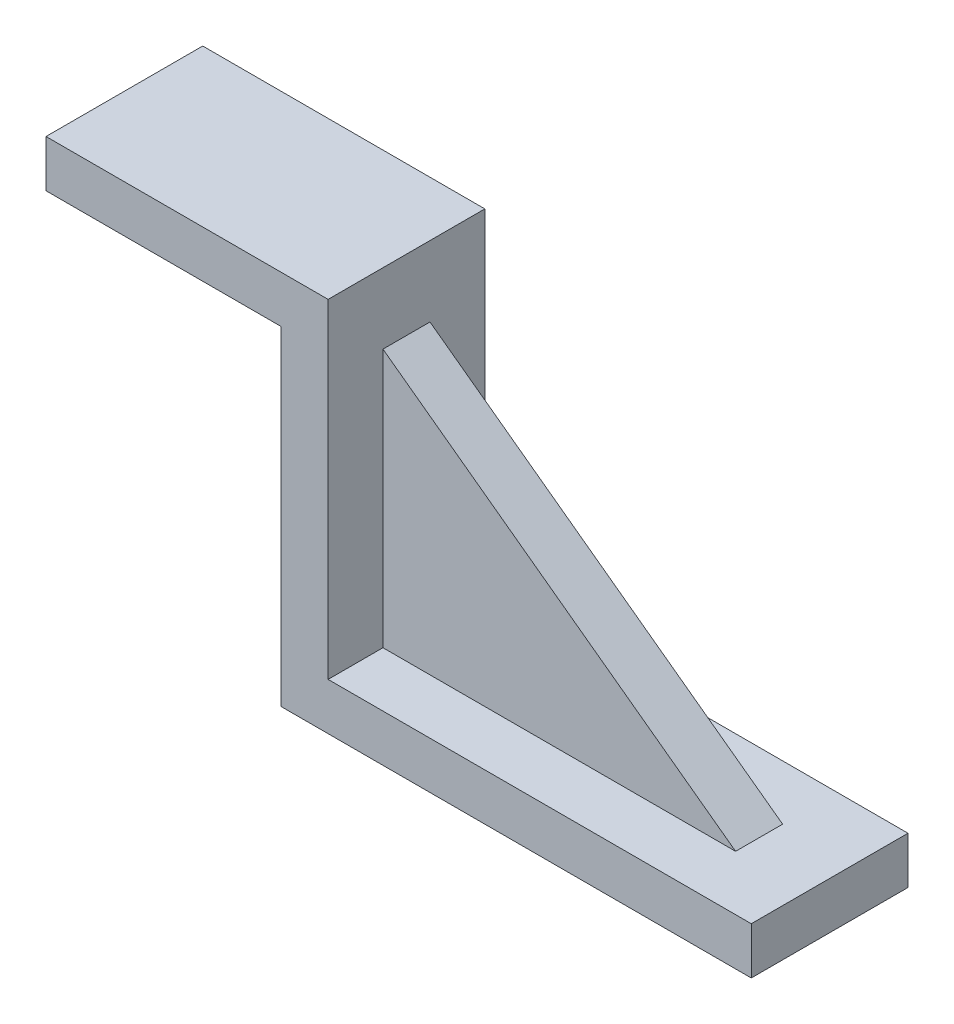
ISO-10303-21;
HEADER;
FILE_DESCRIPTION(('STEP AP214'),'2;1');
FILE_NAME('part.step','',(''),(''),'','','');
FILE_SCHEMA(('AUTOMOTIVE_DESIGN { 1 0 10303 214 1 1 1 1 }'));
ENDSEC;
DATA;
#1=APPLICATION_CONTEXT('core data for automotive mechanical design processes');
#2=APPLICATION_PROTOCOL_DEFINITION('international standard','automotive_design',2000,#1);
#3=PRODUCT_CONTEXT('',#1,'mechanical');
#4=PRODUCT('Part','Part','',(#3));
#5=PRODUCT_RELATED_PRODUCT_CATEGORY('part','',(#4));
#6=PRODUCT_DEFINITION_FORMATION('','',#4);
#7=PRODUCT_DEFINITION_CONTEXT('part definition',#1,'design');
#8=PRODUCT_DEFINITION('design','',#6,#7);
#9=PRODUCT_DEFINITION_SHAPE('','',#8);
#10=(LENGTH_UNIT() NAMED_UNIT(*) SI_UNIT(.MILLI.,.METRE.));
#11=(NAMED_UNIT(*) PLANE_ANGLE_UNIT() SI_UNIT($,.RADIAN.));
#12=(NAMED_UNIT(*) SI_UNIT($,.STERADIAN.) SOLID_ANGLE_UNIT());
#13=UNCERTAINTY_MEASURE_WITH_UNIT(LENGTH_MEASURE(1.E-05),#10,'distance_accuracy_value','');
#14=(GEOMETRIC_REPRESENTATION_CONTEXT(3) GLOBAL_UNCERTAINTY_ASSIGNED_CONTEXT((#13)) GLOBAL_UNIT_ASSIGNED_CONTEXT((#10,
#11,#12)) REPRESENTATION_CONTEXT('',''));
#15=CARTESIAN_POINT('',(0.,0.,0.));
#16=DIRECTION('',(0.,0.,1.));
#17=DIRECTION('',(1.,0.,0.));
#18=AXIS2_PLACEMENT_3D('',#15,#16,#17);
#19=CARTESIAN_POINT('',(-20.,16.,3.33333333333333));
#20=DIRECTION('',(0.,-1.,0.));
#21=DIRECTION('',(0.,0.,-1.));
#22=AXIS2_PLACEMENT_3D('',#19,#20,#21);
#23=PLANE('',#22);
#24=DIRECTION('',(1.,0.,0.));
#25=VECTOR('',#24,1.);
#26=CARTESIAN_POINT('',(-20.,16.,-3.33333333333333));
#27=LINE('',#26,#25);
#28=CARTESIAN_POINT('',(-18.,16.,-3.33333333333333));
#29=VERTEX_POINT('',#28);
#30=CARTESIAN_POINT('',(-30.,16.,-3.33333333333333));
#31=VERTEX_POINT('',#30);
#32=EDGE_CURVE('E136',#29,#31,#27,.F.);
#33=ORIENTED_EDGE('',*,*,#32,.T.);
#34=DIRECTION('',(0.,0.,-1.));
#35=VECTOR('',#34,1.);
#36=CARTESIAN_POINT('',(-30.,16.,3.33333333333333));
#37=LINE('',#36,#35);
#38=CARTESIAN_POINT('',(-30.,16.,3.33333333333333));
#39=VERTEX_POINT('',#38);
#40=EDGE_CURVE('E125',#39,#31,#37,.T.);
#41=ORIENTED_EDGE('',*,*,#40,.F.);
#42=DIRECTION('',(1.,0.,0.));
#43=VECTOR('',#42,1.);
#44=CARTESIAN_POINT('',(-20.,16.,3.33333333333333));
#45=LINE('',#44,#43);
#46=CARTESIAN_POINT('',(-18.,16.,3.33333333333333));
#47=VERTEX_POINT('',#46);
#48=EDGE_CURVE('E159',#47,#39,#45,.F.);
#49=ORIENTED_EDGE('',*,*,#48,.F.);
#50=DIRECTION('',(0.,0.,-1.));
#51=VECTOR('',#50,1.);
#52=CARTESIAN_POINT('',(-18.,16.,3.33333333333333));
#53=LINE('',#52,#51);
#54=EDGE_CURVE('E180',#47,#29,#53,.T.);
#55=ORIENTED_EDGE('',*,*,#54,.T.);
#56=EDGE_LOOP('',(#33,#41,#49,#55));
#57=FACE_BOUND('',#56,.T.);
#58=ADVANCED_FACE('F33',(#57),#23,.F.);
#59=CARTESIAN_POINT('',(-30.,14.,3.33333333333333));
#60=DIRECTION('',(-1.,0.,0.));
#61=DIRECTION('',(0.,0.,1.));
#62=AXIS2_PLACEMENT_3D('',#59,#60,#61);
#63=PLANE('',#62);
#64=ORIENTED_EDGE('',*,*,#40,.T.);
#65=DIRECTION('',(0.,1.,0.));
#66=VECTOR('',#65,1.);
#67=CARTESIAN_POINT('',(-30.,14.,-3.33333333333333));
#68=LINE('',#67,#66);
#69=CARTESIAN_POINT('',(-30.,14.,-3.33333333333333));
#70=VERTEX_POINT('',#69);
#71=EDGE_CURVE('E139',#70,#31,#68,.T.);
#72=ORIENTED_EDGE('',*,*,#71,.F.);
#73=DIRECTION('',(0.,0.,-1.));
#74=VECTOR('',#73,1.);
#75=CARTESIAN_POINT('',(-30.,14.,3.33333333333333));
#76=LINE('',#75,#74);
#77=CARTESIAN_POINT('',(-30.,14.,3.33333333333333));
#78=VERTEX_POINT('',#77);
#79=EDGE_CURVE('E194',#78,#70,#76,.T.);
#80=ORIENTED_EDGE('',*,*,#79,.F.);
#81=DIRECTION('',(0.,1.,0.));
#82=VECTOR('',#81,1.);
#83=CARTESIAN_POINT('',(-30.,14.,3.33333333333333));
#84=LINE('',#83,#82);
#85=EDGE_CURVE('E161',#78,#39,#84,.T.);
#86=ORIENTED_EDGE('',*,*,#85,.T.);
#87=EDGE_LOOP('',(#64,#72,#80,#86));
#88=FACE_BOUND('',#87,.T.);
#89=ADVANCED_FACE('F199',(#88),#63,.T.);
#90=CARTESIAN_POINT('',(-20.,14.,3.33333333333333));
#91=DIRECTION('',(0.,-1.,0.));
#92=DIRECTION('',(0.,0.,-1.));
#93=AXIS2_PLACEMENT_3D('',#90,#91,#92);
#94=PLANE('',#93);
#95=ORIENTED_EDGE('',*,*,#79,.T.);
#96=DIRECTION('',(-1.,0.,0.));
#97=VECTOR('',#96,1.);
#98=CARTESIAN_POINT('',(-20.,14.,-3.33333333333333));
#99=LINE('',#98,#97);
#100=CARTESIAN_POINT('',(-20.,14.,-3.33333333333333));
#101=VERTEX_POINT('',#100);
#102=EDGE_CURVE('E142',#101,#70,#99,.T.);
#103=ORIENTED_EDGE('',*,*,#102,.F.);
#104=DIRECTION('',(0.,0.,-1.));
#105=VECTOR('',#104,1.);
#106=CARTESIAN_POINT('',(-20.,14.,3.33333333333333));
#107=LINE('',#106,#105);
#108=CARTESIAN_POINT('',(-20.,14.,3.33333333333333));
#109=VERTEX_POINT('',#108);
#110=EDGE_CURVE('E192',#109,#101,#107,.T.);
#111=ORIENTED_EDGE('',*,*,#110,.F.);
#112=DIRECTION('',(-1.,0.,0.));
#113=VECTOR('',#112,1.);
#114=CARTESIAN_POINT('',(-20.,14.,3.33333333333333));
#115=LINE('',#114,#113);
#116=EDGE_CURVE('E164',#109,#78,#115,.T.);
#117=ORIENTED_EDGE('',*,*,#116,.T.);
#118=EDGE_LOOP('',(#95,#103,#111,#117));
#119=FACE_BOUND('',#118,.T.);
#120=ADVANCED_FACE('F211',(#119),#94,.T.);
#121=CARTESIAN_POINT('',(-20.,0.,3.33333333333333));
#122=DIRECTION('',(-1.,0.,0.));
#123=DIRECTION('',(0.,0.,1.));
#124=AXIS2_PLACEMENT_3D('',#121,#122,#123);
#125=PLANE('',#124);
#126=ORIENTED_EDGE('',*,*,#110,.T.);
#127=DIRECTION('',(0.,1.,0.));
#128=VECTOR('',#127,1.);
#129=CARTESIAN_POINT('',(-20.,0.,-3.33333333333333));
#130=LINE('',#129,#128);
#131=CARTESIAN_POINT('',(-20.,0.,-3.33333333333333));
#132=VERTEX_POINT('',#131);
#133=EDGE_CURVE('E145',#132,#101,#130,.T.);
#134=ORIENTED_EDGE('',*,*,#133,.F.);
#135=DIRECTION('',(0.,0.,-1.));
#136=VECTOR('',#135,1.);
#137=CARTESIAN_POINT('',(-20.,0.,3.33333333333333));
#138=LINE('',#137,#136);
#139=CARTESIAN_POINT('',(-20.,0.,3.33333333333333));
#140=VERTEX_POINT('',#139);
#141=EDGE_CURVE('E190',#140,#132,#138,.T.);
#142=ORIENTED_EDGE('',*,*,#141,.F.);
#143=DIRECTION('',(0.,1.,0.));
#144=VECTOR('',#143,1.);
#145=CARTESIAN_POINT('',(-20.,0.,3.33333333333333));
#146=LINE('',#145,#144);
#147=EDGE_CURVE('E167',#140,#109,#146,.T.);
#148=ORIENTED_EDGE('',*,*,#147,.T.);
#149=EDGE_LOOP('',(#126,#134,#142,#148));
#150=FACE_BOUND('',#149,.T.);
#151=ADVANCED_FACE('F229',(#150),#125,.T.);
#152=CARTESIAN_POINT('',(0.,0.,3.33333333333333));
#153=DIRECTION('',(0.,-1.,0.));
#154=DIRECTION('',(1.,0.,0.));
#155=AXIS2_PLACEMENT_3D('',#152,#153,#154);
#156=PLANE('',#155);
#157=ORIENTED_EDGE('',*,*,#141,.T.);
#158=DIRECTION('',(-1.,0.,0.));
#159=VECTOR('',#158,1.);
#160=CARTESIAN_POINT('',(0.,0.,-3.33333333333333));
#161=LINE('',#160,#159);
#162=CARTESIAN_POINT('',(0.,0.,-3.33333333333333));
#163=VERTEX_POINT('',#162);
#164=EDGE_CURVE('E148',#163,#132,#161,.T.);
#165=ORIENTED_EDGE('',*,*,#164,.F.);
#166=DIRECTION('',(0.,0.,-1.));
#167=VECTOR('',#166,1.);
#168=CARTESIAN_POINT('',(0.,0.,3.33333333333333));
#169=LINE('',#168,#167);
#170=CARTESIAN_POINT('',(0.,0.,3.33333333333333));
#171=VERTEX_POINT('',#170);
#172=EDGE_CURVE('E188',#171,#163,#169,.T.);
#173=ORIENTED_EDGE('',*,*,#172,.F.);
#174=DIRECTION('',(-1.,0.,0.));
#175=VECTOR('',#174,1.);
#176=CARTESIAN_POINT('',(0.,0.,3.33333333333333));
#177=LINE('',#176,#175);
#178=EDGE_CURVE('E170',#171,#140,#177,.T.);
#179=ORIENTED_EDGE('',*,*,#178,.T.);
#180=EDGE_LOOP('',(#157,#165,#173,#179));
#181=FACE_BOUND('',#180,.T.);
#182=ADVANCED_FACE('F227',(#181),#156,.T.);
#183=CARTESIAN_POINT('',(0.,2.,3.33333333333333));
#184=DIRECTION('',(1.,0.,0.));
#185=DIRECTION('',(0.,1.,0.));
#186=AXIS2_PLACEMENT_3D('',#183,#184,#185);
#187=PLANE('',#186);
#188=DIRECTION('',(0.,-1.,0.));
#189=VECTOR('',#188,1.);
#190=CARTESIAN_POINT('',(0.,2.,-3.33333333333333));
#191=LINE('',#190,#189);
#192=CARTESIAN_POINT('',(0.,2.,-3.33333333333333));
#193=VERTEX_POINT('',#192);
#194=EDGE_CURVE('E151',#193,#163,#191,.T.);
#195=ORIENTED_EDGE('',*,*,#194,.F.);
#196=DIRECTION('',(0.,0.,-1.));
#197=VECTOR('',#196,1.);
#198=CARTESIAN_POINT('',(0.,2.,3.33333333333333));
#199=LINE('',#198,#197);
#200=CARTESIAN_POINT('',(0.,2.,3.33333333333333));
#201=VERTEX_POINT('',#200);
#202=EDGE_CURVE('E186',#201,#193,#199,.T.);
#203=ORIENTED_EDGE('',*,*,#202,.F.);
#204=DIRECTION('',(0.,-1.,0.));
#205=VECTOR('',#204,1.);
#206=CARTESIAN_POINT('',(0.,2.,3.33333333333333));
#207=LINE('',#206,#205);
#208=EDGE_CURVE('E173',#201,#171,#207,.T.);
#209=ORIENTED_EDGE('',*,*,#208,.T.);
#210=ORIENTED_EDGE('',*,*,#172,.T.);
#211=EDGE_LOOP('',(#195,#203,#209,#210));
#212=FACE_BOUND('',#211,.T.);
#213=ADVANCED_FACE('F223',(#212),#187,.T.);
#214=CARTESIAN_POINT('',(0.,2.,3.33333333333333));
#215=DIRECTION('',(0.,-1.,0.));
#216=DIRECTION('',(1.,0.,0.));
#217=AXIS2_PLACEMENT_3D('',#214,#215,#216);
#218=PLANE('',#217);
#219=DIRECTION('',(0.,0.,-1.));
#220=VECTOR('',#219,1.);
#221=CARTESIAN_POINT('',(-3.,2.,3.33333333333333));
#222=LINE('',#221,#220);
#223=CARTESIAN_POINT('',(-3.,2.,-1.));
#224=VERTEX_POINT('',#223);
#225=CARTESIAN_POINT('',(-3.,2.,1.));
#226=VERTEX_POINT('',#225);
#227=EDGE_CURVE('E47',#224,#226,#222,.F.);
#228=ORIENTED_EDGE('',*,*,#227,.T.);
#229=DIRECTION('',(-1.,0.,0.));
#230=VECTOR('',#229,1.);
#231=CARTESIAN_POINT('',(0.,2.,1.));
#232=LINE('',#231,#230);
#233=CARTESIAN_POINT('',(-18.,2.,1.));
#234=VERTEX_POINT('',#233);
#235=EDGE_CURVE('E133',#226,#234,#232,.T.);
#236=ORIENTED_EDGE('',*,*,#235,.T.);
#237=DIRECTION('',(0.,0.,-1.));
#238=VECTOR('',#237,1.);
#239=CARTESIAN_POINT('',(-18.,2.,3.33333333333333));
#240=LINE('',#239,#238);
#241=CARTESIAN_POINT('',(-18.,2.,3.33333333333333));
#242=VERTEX_POINT('',#241);
#243=EDGE_CURVE('E184',#242,#234,#240,.T.);
#244=ORIENTED_EDGE('',*,*,#243,.F.);
#245=DIRECTION('',(-1.,0.,0.));
#246=VECTOR('',#245,1.);
#247=CARTESIAN_POINT('',(0.,2.,3.33333333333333));
#248=LINE('',#247,#246);
#249=EDGE_CURVE('E176',#201,#242,#248,.T.);
#250=ORIENTED_EDGE('',*,*,#249,.F.);
#251=ORIENTED_EDGE('',*,*,#202,.T.);
#252=DIRECTION('',(-1.,0.,0.));
#253=VECTOR('',#252,1.);
#254=CARTESIAN_POINT('',(0.,2.,-3.33333333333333));
#255=LINE('',#254,#253);
#256=CARTESIAN_POINT('',(-18.,2.,-3.33333333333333));
#257=VERTEX_POINT('',#256);
#258=EDGE_CURVE('E154',#193,#257,#255,.T.);
#259=ORIENTED_EDGE('',*,*,#258,.T.);
#260=CARTESIAN_POINT('',(-18.,2.,-1.));
#261=VERTEX_POINT('',#260);
#262=EDGE_CURVE('E183',#261,#257,#240,.T.);
#263=ORIENTED_EDGE('',*,*,#262,.F.);
#264=DIRECTION('',(-1.,0.,0.));
#265=VECTOR('',#264,1.);
#266=CARTESIAN_POINT('',(0.,2.,-1.));
#267=LINE('',#266,#265);
#268=EDGE_CURVE('E52',#224,#261,#267,.T.);
#269=ORIENTED_EDGE('',*,*,#268,.F.);
#270=EDGE_LOOP('',(#228,#236,#244,#250,#251,#259,#263,#269));
#271=FACE_BOUND('',#270,.T.);
#272=ADVANCED_FACE('F265',(#271),#218,.F.);
#273=CARTESIAN_POINT('',(-18.,0.,3.33333333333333));
#274=DIRECTION('',(-1.,0.,0.));
#275=DIRECTION('',(0.,0.,1.));
#276=AXIS2_PLACEMENT_3D('',#273,#274,#275);
#277=PLANE('',#276);
#278=ORIENTED_EDGE('',*,*,#243,.T.);
#279=DIRECTION('',(0.,1.,0.));
#280=VECTOR('',#279,1.);
#281=CARTESIAN_POINT('',(-18.,0.,1.));
#282=LINE('',#281,#280);
#283=CARTESIAN_POINT('',(-18.,13.,1.));
#284=VERTEX_POINT('',#283);
#285=EDGE_CURVE('E11',#234,#284,#282,.T.);
#286=ORIENTED_EDGE('',*,*,#285,.T.);
#287=DIRECTION('',(0.,0.,1.));
#288=VECTOR('',#287,1.);
#289=CARTESIAN_POINT('',(-18.,13.,3.33333333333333));
#290=LINE('',#289,#288);
#291=CARTESIAN_POINT('',(-18.,13.,-1.));
#292=VERTEX_POINT('',#291);
#293=EDGE_CURVE('E40',#284,#292,#290,.F.);
#294=ORIENTED_EDGE('',*,*,#293,.T.);
#295=DIRECTION('',(0.,1.,0.));
#296=VECTOR('',#295,1.);
#297=CARTESIAN_POINT('',(-18.,0.,-1.));
#298=LINE('',#297,#296);
#299=EDGE_CURVE('E115',#261,#292,#298,.T.);
#300=ORIENTED_EDGE('',*,*,#299,.F.);
#301=ORIENTED_EDGE('',*,*,#262,.T.);
#302=DIRECTION('',(0.,1.,0.));
#303=VECTOR('',#302,1.);
#304=CARTESIAN_POINT('',(-18.,0.,-3.33333333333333));
#305=LINE('',#304,#303);
#306=EDGE_CURVE('E157',#257,#29,#305,.T.);
#307=ORIENTED_EDGE('',*,*,#306,.T.);
#308=ORIENTED_EDGE('',*,*,#54,.F.);
#309=DIRECTION('',(0.,1.,0.));
#310=VECTOR('',#309,1.);
#311=CARTESIAN_POINT('',(-18.,0.,3.33333333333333));
#312=LINE('',#311,#310);
#313=EDGE_CURVE('E178',#242,#47,#312,.T.);
#314=ORIENTED_EDGE('',*,*,#313,.F.);
#315=EDGE_LOOP('',(#278,#286,#294,#300,#301,#307,#308,#314));
#316=FACE_BOUND('',#315,.T.);
#317=ADVANCED_FACE('F114',(#316),#277,.F.);
#318=CARTESIAN_POINT('',(-30.,16.,3.33333333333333));
#319=DIRECTION('',(0.,0.,1.));
#320=DIRECTION('',(1.,0.,0.));
#321=AXIS2_PLACEMENT_3D('',#318,#319,#320);
#322=PLANE('',#321);
#323=ORIENTED_EDGE('',*,*,#48,.T.);
#324=ORIENTED_EDGE('',*,*,#85,.F.);
#325=ORIENTED_EDGE('',*,*,#116,.F.);
#326=ORIENTED_EDGE('',*,*,#147,.F.);
#327=ORIENTED_EDGE('',*,*,#178,.F.);
#328=ORIENTED_EDGE('',*,*,#208,.F.);
#329=ORIENTED_EDGE('',*,*,#249,.T.);
#330=ORIENTED_EDGE('',*,*,#313,.T.);
#331=EDGE_LOOP('',(#323,#324,#325,#326,#327,#328,#329,#330));
#332=FACE_BOUND('',#331,.T.);
#333=ADVANCED_FACE('F214',(#332),#322,.T.);
#334=CARTESIAN_POINT('',(-30.,16.,-3.33333333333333));
#335=DIRECTION('',(0.,0.,1.));
#336=DIRECTION('',(1.,0.,0.));
#337=AXIS2_PLACEMENT_3D('',#334,#335,#336);
#338=PLANE('',#337);
#339=ORIENTED_EDGE('',*,*,#32,.F.);
#340=ORIENTED_EDGE('',*,*,#306,.F.);
#341=ORIENTED_EDGE('',*,*,#258,.F.);
#342=ORIENTED_EDGE('',*,*,#194,.T.);
#343=ORIENTED_EDGE('',*,*,#164,.T.);
#344=ORIENTED_EDGE('',*,*,#133,.T.);
#345=ORIENTED_EDGE('',*,*,#102,.T.);
#346=ORIENTED_EDGE('',*,*,#71,.T.);
#347=EDGE_LOOP('',(#339,#340,#341,#342,#343,#344,#345,#346));
#348=FACE_BOUND('',#347,.T.);
#349=ADVANCED_FACE('F207',(#348),#338,.F.);
#350=CARTESIAN_POINT('',(-18.,13.,0.));
#351=DIRECTION('',(-0.591363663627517,-0.806404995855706,0.));
#352=DIRECTION('',(0.806404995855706,-0.591363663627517,0.));
#353=AXIS2_PLACEMENT_3D('',#350,#351,#352);
#354=PLANE('',#353);
#355=ORIENTED_EDGE('',*,*,#227,.F.);
#356=DIRECTION('',(0.806404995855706,-0.591363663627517,0.));
#357=VECTOR('',#356,1.);
#358=CARTESIAN_POINT('',(-18.,13.,-1.));
#359=LINE('',#358,#357);
#360=EDGE_CURVE('E124',#292,#224,#359,.T.);
#361=ORIENTED_EDGE('',*,*,#360,.F.);
#362=ORIENTED_EDGE('',*,*,#293,.F.);
#363=DIRECTION('',(0.806404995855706,-0.591363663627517,0.));
#364=VECTOR('',#363,1.);
#365=CARTESIAN_POINT('',(-18.,13.,1.));
#366=LINE('',#365,#364);
#367=EDGE_CURVE('E128',#284,#226,#366,.T.);
#368=ORIENTED_EDGE('',*,*,#367,.T.);
#369=EDGE_LOOP('',(#355,#361,#362,#368));
#370=FACE_BOUND('',#369,.T.);
#371=ADVANCED_FACE('F127',(#370),#354,.F.);
#372=CARTESIAN_POINT('',(-15.,8.,1.));
#373=DIRECTION('',(0.,0.,1.));
#374=DIRECTION('',(1.,0.,0.));
#375=AXIS2_PLACEMENT_3D('',#372,#373,#374);
#376=PLANE('',#375);
#377=ORIENTED_EDGE('',*,*,#235,.F.);
#378=ORIENTED_EDGE('',*,*,#367,.F.);
#379=ORIENTED_EDGE('',*,*,#285,.F.);
#380=EDGE_LOOP('',(#377,#378,#379));
#381=FACE_BOUND('',#380,.T.);
#382=ADVANCED_FACE('F288',(#381),#376,.T.);
#383=CARTESIAN_POINT('',(-15.,8.,-1.));
#384=DIRECTION('',(0.,0.,1.));
#385=DIRECTION('',(1.,0.,0.));
#386=AXIS2_PLACEMENT_3D('',#383,#384,#385);
#387=PLANE('',#386);
#388=ORIENTED_EDGE('',*,*,#360,.T.);
#389=ORIENTED_EDGE('',*,*,#268,.T.);
#390=ORIENTED_EDGE('',*,*,#299,.T.);
#391=EDGE_LOOP('',(#388,#389,#390));
#392=FACE_BOUND('',#391,.T.);
#393=ADVANCED_FACE('F123',(#392),#387,.F.);
#394=CLOSED_SHELL('',(#58,#89,#120,#151,#182,#213,#272,#317,#333,#349,#371,#382,#393));
#395=MANIFOLD_SOLID_BREP('B2',#394);
#396=ADVANCED_BREP_SHAPE_REPRESENTATION('',(#18,#395),#14);
#397=SHAPE_DEFINITION_REPRESENTATION(#9,#396);
ENDSEC;
END-ISO-10303-21;
